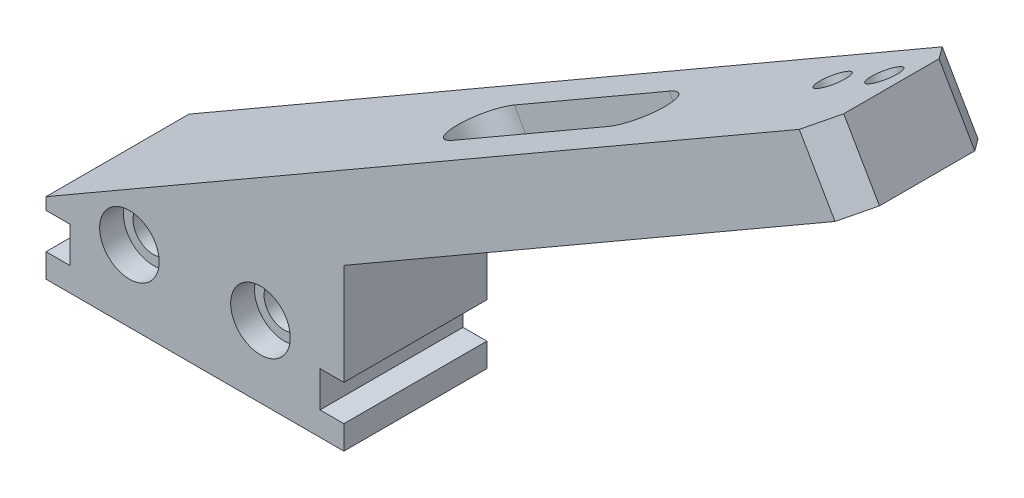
ISO-10303-21;
HEADER;
FILE_DESCRIPTION(('STEP AP214'),'2;1');
FILE_NAME('part.step','',(''),(''),'','','');
FILE_SCHEMA(('AUTOMOTIVE_DESIGN { 1 0 10303 214 1 1 1 1 }'));
ENDSEC;
DATA;
#1=APPLICATION_CONTEXT('core data for automotive mechanical design processes');
#2=APPLICATION_PROTOCOL_DEFINITION('international standard','automotive_design',2000,#1);
#3=PRODUCT_CONTEXT('',#1,'mechanical');
#4=PRODUCT('Part','Part','',(#3));
#5=PRODUCT_RELATED_PRODUCT_CATEGORY('part','',(#4));
#6=PRODUCT_DEFINITION_FORMATION('','',#4);
#7=PRODUCT_DEFINITION_CONTEXT('part definition',#1,'design');
#8=PRODUCT_DEFINITION('design','',#6,#7);
#9=PRODUCT_DEFINITION_SHAPE('','',#8);
#10=(LENGTH_UNIT() NAMED_UNIT(*) SI_UNIT(.MILLI.,.METRE.));
#11=(NAMED_UNIT(*) PLANE_ANGLE_UNIT() SI_UNIT($,.RADIAN.));
#12=(NAMED_UNIT(*) SI_UNIT($,.STERADIAN.) SOLID_ANGLE_UNIT());
#13=UNCERTAINTY_MEASURE_WITH_UNIT(LENGTH_MEASURE(1.E-05),#10,'distance_accuracy_value','');
#14=(GEOMETRIC_REPRESENTATION_CONTEXT(3) GLOBAL_UNCERTAINTY_ASSIGNED_CONTEXT((#13)) GLOBAL_UNIT_ASSIGNED_CONTEXT((#10,
#11,#12)) REPRESENTATION_CONTEXT('',''));
#15=CARTESIAN_POINT('',(0.,0.,0.));
#16=DIRECTION('',(0.,0.,1.));
#17=DIRECTION('',(1.,0.,0.));
#18=AXIS2_PLACEMENT_3D('',#15,#16,#17);
#19=CARTESIAN_POINT('',(29.3301270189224,-84.2630029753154,12.));
#20=DIRECTION('',(-1.,0.,0.));
#21=DIRECTION('',(0.,0.,1.));
#22=AXIS2_PLACEMENT_3D('',#19,#20,#21);
#23=PLANE('',#22);
#24=DIRECTION('',(0.,1.,0.));
#25=VECTOR('',#24,1.);
#26=CARTESIAN_POINT('',(29.3301270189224,-84.2630029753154,0.));
#27=LINE('',#26,#25);
#28=CARTESIAN_POINT('',(29.3301270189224,-84.2630029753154,0.));
#29=VERTEX_POINT('',#28);
#30=CARTESIAN_POINT('',(29.3301270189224,-82.2630029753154,0.));
#31=VERTEX_POINT('',#30);
#32=EDGE_CURVE('E289',#29,#31,#27,.T.);
#33=ORIENTED_EDGE('',*,*,#32,.T.);
#34=DIRECTION('',(0.,0.,1.));
#35=VECTOR('',#34,1.);
#36=CARTESIAN_POINT('',(29.3301270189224,-82.2630029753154,12.));
#37=LINE('',#36,#35);
#38=CARTESIAN_POINT('',(29.3301270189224,-82.2630029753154,12.));
#39=VERTEX_POINT('',#38);
#40=EDGE_CURVE('E167',#31,#39,#37,.T.);
#41=ORIENTED_EDGE('',*,*,#40,.T.);
#42=DIRECTION('',(0.,1.,0.));
#43=VECTOR('',#42,1.);
#44=CARTESIAN_POINT('',(29.3301270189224,-84.2630029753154,12.));
#45=LINE('',#44,#43);
#46=CARTESIAN_POINT('',(29.3301270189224,-84.2630029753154,12.));
#47=VERTEX_POINT('',#46);
#48=EDGE_CURVE('E273',#47,#39,#45,.T.);
#49=ORIENTED_EDGE('',*,*,#48,.F.);
#50=DIRECTION('',(0.,0.,-1.));
#51=VECTOR('',#50,1.);
#52=CARTESIAN_POINT('',(29.3301270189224,-84.2630029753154,12.));
#53=LINE('',#52,#51);
#54=EDGE_CURVE('E313',#47,#29,#53,.T.);
#55=ORIENTED_EDGE('',*,*,#54,.T.);
#56=EDGE_LOOP('',(#33,#41,#49,#55));
#57=FACE_BOUND('',#56,.T.);
#58=ADVANCED_FACE('F16',(#57),#23,.F.);
#59=CARTESIAN_POINT('',(4.33012701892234,-84.2630029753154,12.));
#60=DIRECTION('',(1.,0.,0.));
#61=DIRECTION('',(0.,1.,0.));
#62=AXIS2_PLACEMENT_3D('',#59,#60,#61);
#63=PLANE('',#62);
#64=DIRECTION('',(0.,-1.,0.));
#65=VECTOR('',#64,1.);
#66=CARTESIAN_POINT('',(4.33012701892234,-84.2630029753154,12.));
#67=LINE('',#66,#65);
#68=CARTESIAN_POINT('',(4.3301270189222,-82.2630029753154,12.));
#69=VERTEX_POINT('',#68);
#70=CARTESIAN_POINT('',(4.33012701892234,-84.2630029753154,12.));
#71=VERTEX_POINT('',#70);
#72=EDGE_CURVE('E281',#69,#71,#67,.T.);
#73=ORIENTED_EDGE('',*,*,#72,.F.);
#74=DIRECTION('',(0.,0.,-1.));
#75=VECTOR('',#74,1.);
#76=CARTESIAN_POINT('',(4.3301270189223,-82.2630029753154,12.));
#77=LINE('',#76,#75);
#78=CARTESIAN_POINT('',(4.3301270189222,-82.2630029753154,0.));
#79=VERTEX_POINT('',#78);
#80=EDGE_CURVE('E202',#69,#79,#77,.T.);
#81=ORIENTED_EDGE('',*,*,#80,.T.);
#82=DIRECTION('',(0.,-1.,0.));
#83=VECTOR('',#82,1.);
#84=CARTESIAN_POINT('',(4.33012701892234,-84.2630029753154,0.));
#85=LINE('',#84,#83);
#86=CARTESIAN_POINT('',(4.33012701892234,-84.2630029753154,0.));
#87=VERTEX_POINT('',#86);
#88=EDGE_CURVE('E296',#79,#87,#85,.T.);
#89=ORIENTED_EDGE('',*,*,#88,.T.);
#90=DIRECTION('',(0.,0.,-1.));
#91=VECTOR('',#90,1.);
#92=CARTESIAN_POINT('',(4.33012701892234,-84.2630029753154,12.));
#93=LINE('',#92,#91);
#94=EDGE_CURVE('E285',#71,#87,#93,.T.);
#95=ORIENTED_EDGE('',*,*,#94,.F.);
#96=EDGE_LOOP('',(#73,#81,#89,#95));
#97=FACE_BOUND('',#96,.T.);
#98=ADVANCED_FACE('F360',(#97),#63,.F.);
#99=CARTESIAN_POINT('',(4.33012701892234,-84.2630029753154,12.));
#100=DIRECTION('',(0.,1.,0.));
#101=DIRECTION('',(0.,0.,1.));
#102=AXIS2_PLACEMENT_3D('',#99,#100,#101);
#103=PLANE('',#102);
#104=DIRECTION('',(1.,0.,0.));
#105=VECTOR('',#104,1.);
#106=CARTESIAN_POINT('',(4.33012701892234,-84.2630029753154,0.));
#107=LINE('',#106,#105);
#108=EDGE_CURVE('E265',#87,#29,#107,.T.);
#109=ORIENTED_EDGE('',*,*,#108,.T.);
#110=ORIENTED_EDGE('',*,*,#54,.F.);
#111=DIRECTION('',(1.,0.,0.));
#112=VECTOR('',#111,1.);
#113=CARTESIAN_POINT('',(4.33012701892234,-84.2630029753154,12.));
#114=LINE('',#113,#112);
#115=EDGE_CURVE('E268',#71,#47,#114,.T.);
#116=ORIENTED_EDGE('',*,*,#115,.F.);
#117=ORIENTED_EDGE('',*,*,#94,.T.);
#118=EDGE_LOOP('',(#109,#110,#116,#117));
#119=FACE_BOUND('',#118,.T.);
#120=ADVANCED_FACE('F407',(#119),#103,.F.);
#121=CARTESIAN_POINT('',(29.3301270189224,-79.2630029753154,12.));
#122=VERTEX_POINT('',#121);
#123=CARTESIAN_POINT('',(29.3301270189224,-70.7574494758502,12.));
#124=VERTEX_POINT('',#123);
#125=EDGE_CURVE('E271',#122,#124,#45,.T.);
#126=ORIENTED_EDGE('',*,*,#125,.F.);
#127=DIRECTION('',(0.,0.,-1.));
#128=VECTOR('',#127,1.);
#129=CARTESIAN_POINT('',(29.3301270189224,-79.2630029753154,12.));
#130=LINE('',#129,#128);
#131=CARTESIAN_POINT('',(29.3301270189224,-79.2630029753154,0.));
#132=VERTEX_POINT('',#131);
#133=EDGE_CURVE('E160',#122,#132,#130,.T.);
#134=ORIENTED_EDGE('',*,*,#133,.T.);
#135=CARTESIAN_POINT('',(29.3301270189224,-70.7574494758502,0.));
#136=VERTEX_POINT('',#135);
#137=EDGE_CURVE('E288',#132,#136,#27,.T.);
#138=ORIENTED_EDGE('',*,*,#137,.T.);
#139=DIRECTION('',(0.,0.,-1.));
#140=VECTOR('',#139,1.);
#141=CARTESIAN_POINT('',(29.3301270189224,-70.7574494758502,12.));
#142=LINE('',#141,#140);
#143=EDGE_CURVE('E310',#124,#136,#142,.T.);
#144=ORIENTED_EDGE('',*,*,#143,.F.);
#145=EDGE_LOOP('',(#126,#134,#138,#144));
#146=FACE_BOUND('',#145,.T.);
#147=ADVANCED_FACE('F402',(#146),#23,.F.);
#148=CARTESIAN_POINT('',(72.2820323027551,-45.9591553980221,12.));
#149=DIRECTION('',(-0.5,0.866025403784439,0.));
#150=DIRECTION('',(-0.866025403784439,-0.5,0.));
#151=AXIS2_PLACEMENT_3D('',#148,#149,#150);
#152=PLANE('',#151);
#153=DIRECTION('',(0.866025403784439,0.5,0.));
#154=VECTOR('',#153,1.);
#155=CARTESIAN_POINT('',(38.0740288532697,-65.7091553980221,3.43164048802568));
#156=LINE('',#155,#154);
#157=CARTESIAN_POINT('',(38.0740288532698,-65.7091553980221,3.43164048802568));
#158=VERTEX_POINT('',#157);
#159=CARTESIAN_POINT('',(51.0644099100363,-58.2091553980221,3.43164048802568));
#160=VERTEX_POINT('',#159);
#161=EDGE_CURVE('E207',#158,#160,#156,.T.);
#162=ORIENTED_EDGE('',*,*,#161,.F.);
#163=CARTESIAN_POINT('',(38.0740288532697,-65.7091553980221,6.));
#164=DIRECTION('',(0.5,-0.866025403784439,0.));
#165=DIRECTION('',(0.866025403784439,0.5,0.));
#166=AXIS2_PLACEMENT_3D('',#163,#164,#165);
#167=CIRCLE('',#166,2.56835951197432);
#168=CARTESIAN_POINT('',(38.0740288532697,-65.7091553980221,8.56835951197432));
#169=VERTEX_POINT('',#168);
#170=EDGE_CURVE('E205',#169,#158,#167,.T.);
#171=ORIENTED_EDGE('',*,*,#170,.F.);
#172=DIRECTION('',(-0.866025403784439,-0.5,0.));
#173=VECTOR('',#172,1.);
#174=CARTESIAN_POINT('',(38.0740288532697,-65.7091553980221,8.56835951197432));
#175=LINE('',#174,#173);
#176=CARTESIAN_POINT('',(51.0644099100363,-58.2091553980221,8.56835951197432));
#177=VERTEX_POINT('',#176);
#178=EDGE_CURVE('E213',#177,#169,#175,.T.);
#179=ORIENTED_EDGE('',*,*,#178,.F.);
#180=CARTESIAN_POINT('',(51.0644099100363,-58.2091553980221,6.));
#181=DIRECTION('',(0.5,-0.866025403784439,0.));
#182=DIRECTION('',(0.866025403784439,0.5,0.));
#183=AXIS2_PLACEMENT_3D('',#180,#181,#182);
#184=CIRCLE('',#183,2.56835951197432);
#185=EDGE_CURVE('E210',#160,#177,#184,.T.);
#186=ORIENTED_EDGE('',*,*,#185,.F.);
#187=EDGE_LOOP('',(#162,#171,#179,#186));
#188=FACE_BOUND('',#187,.T.);
#189=CARTESIAN_POINT('',(69.683956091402,-47.4591553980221,4.));
#190=DIRECTION('',(0.5,-0.86602540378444,0.));
#191=DIRECTION('',(0.86602540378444,0.5,0.));
#192=AXIS2_PLACEMENT_3D('',#189,#190,#191);
#193=CIRCLE('',#192,1.24999999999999);
#194=CARTESIAN_POINT('',(70.7664878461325,-46.8341553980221,4.));
#195=VERTEX_POINT('',#194);
#196=EDGE_CURVE('E219',#195,#195,#193,.T.);
#197=ORIENTED_EDGE('',*,*,#196,.F.);
#198=EDGE_LOOP('',(#197));
#199=FACE_BOUND('',#198,.T.);
#200=CARTESIAN_POINT('',(65.3538290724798,-49.959155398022,4.));
#201=DIRECTION('',(0.5,-0.86602540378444,0.));
#202=DIRECTION('',(0.86602540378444,0.5,0.));
#203=AXIS2_PLACEMENT_3D('',#200,#201,#202);
#204=CIRCLE('',#203,1.24999999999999);
#205=CARTESIAN_POINT('',(66.4363608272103,-49.334155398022,4.));
#206=VERTEX_POINT('',#205);
#207=EDGE_CURVE('E229',#206,#206,#204,.T.);
#208=ORIENTED_EDGE('',*,*,#207,.F.);
#209=EDGE_LOOP('',(#208));
#210=FACE_BOUND('',#209,.T.);
#211=DIRECTION('',(0.866025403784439,0.5,0.));
#212=VECTOR('',#211,1.);
#213=CARTESIAN_POINT('',(72.2820323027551,-45.9591553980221,0.));
#214=LINE('',#213,#212);
#215=CARTESIAN_POINT('',(70.5499814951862,-46.9591553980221,0.));
#216=VERTEX_POINT('',#215);
#217=EDGE_CURVE('E291',#136,#216,#214,.T.);
#218=ORIENTED_EDGE('',*,*,#217,.T.);
#219=DIRECTION('',(-0.612372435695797,-0.353553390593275,-0.707106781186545));
#220=VECTOR('',#219,1.);
#221=CARTESIAN_POINT('',(72.2820323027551,-45.9591553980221,2.));
#222=LINE('',#221,#220);
#223=CARTESIAN_POINT('',(72.2820323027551,-45.9591553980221,2.));
#224=VERTEX_POINT('',#223);
#225=EDGE_CURVE('E335',#216,#224,#222,.F.);
#226=ORIENTED_EDGE('',*,*,#225,.T.);
#227=DIRECTION('',(0.,0.,-1.));
#228=VECTOR('',#227,1.);
#229=CARTESIAN_POINT('',(72.2820323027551,-45.9591553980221,12.));
#230=LINE('',#229,#228);
#231=CARTESIAN_POINT('',(72.2820323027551,-45.9591553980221,10.));
#232=VERTEX_POINT('',#231);
#233=EDGE_CURVE('E307',#232,#224,#230,.T.);
#234=ORIENTED_EDGE('',*,*,#233,.F.);
#235=DIRECTION('',(-0.612372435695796,-0.353553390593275,0.707106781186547));
#236=VECTOR('',#235,1.);
#237=CARTESIAN_POINT('',(70.5499814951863,-46.959155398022,11.9999999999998));
#238=LINE('',#237,#236);
#239=CARTESIAN_POINT('',(70.5499814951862,-46.9591553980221,12.));
#240=VERTEX_POINT('',#239);
#241=EDGE_CURVE('E333',#232,#240,#238,.T.);
#242=ORIENTED_EDGE('',*,*,#241,.T.);
#243=DIRECTION('',(0.866025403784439,0.5,0.));
#244=VECTOR('',#243,1.);
#245=CARTESIAN_POINT('',(72.2820323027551,-45.9591553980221,12.));
#246=LINE('',#245,#244);
#247=EDGE_CURVE('E276',#124,#240,#246,.T.);
#248=ORIENTED_EDGE('',*,*,#247,.F.);
#249=ORIENTED_EDGE('',*,*,#143,.T.);
#250=EDGE_LOOP('',(#218,#226,#234,#242,#248,#249));
#251=FACE_BOUND('',#250,.T.);
#252=ADVANCED_FACE('F389',(#188,#199,#210,#251),#152,.F.);
#253=CARTESIAN_POINT('',(69.2820323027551,-40.7630029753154,12.));
#254=DIRECTION('',(-0.866025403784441,-0.5,0.));
#255=DIRECTION('',(0.5,-0.866025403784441,0.));
#256=AXIS2_PLACEMENT_3D('',#253,#254,#255);
#257=PLANE('',#256);
#258=ORIENTED_EDGE('',*,*,#233,.T.);
#259=DIRECTION('',(-0.5,0.866025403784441,0.));
#260=VECTOR('',#259,1.);
#261=CARTESIAN_POINT('',(69.2820323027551,-40.7630029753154,2.));
#262=LINE('',#261,#260);
#263=CARTESIAN_POINT('',(69.2820323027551,-40.7630029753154,2.));
#264=VERTEX_POINT('',#263);
#265=EDGE_CURVE('E324',#224,#264,#262,.T.);
#266=ORIENTED_EDGE('',*,*,#265,.T.);
#267=DIRECTION('',(0.,0.,-1.));
#268=VECTOR('',#267,1.);
#269=CARTESIAN_POINT('',(69.2820323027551,-40.7630029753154,12.));
#270=LINE('',#269,#268);
#271=CARTESIAN_POINT('',(69.2820323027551,-40.7630029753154,10.));
#272=VERTEX_POINT('',#271);
#273=EDGE_CURVE('E304',#272,#264,#270,.T.);
#274=ORIENTED_EDGE('',*,*,#273,.F.);
#275=DIRECTION('',(0.5,-0.866025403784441,0.));
#276=VECTOR('',#275,1.);
#277=CARTESIAN_POINT('',(72.2820323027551,-45.9591553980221,10.));
#278=LINE('',#277,#276);
#279=EDGE_CURVE('E316',#272,#232,#278,.T.);
#280=ORIENTED_EDGE('',*,*,#279,.T.);
#281=EDGE_LOOP('',(#258,#266,#274,#280));
#282=FACE_BOUND('',#281,.T.);
#283=ADVANCED_FACE('F392',(#282),#257,.F.);
#284=CARTESIAN_POINT('',(69.2820323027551,-40.7630029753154,12.));
#285=DIRECTION('',(0.5,-0.866025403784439,0.));
#286=DIRECTION('',(0.866025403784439,0.5,0.));
#287=AXIS2_PLACEMENT_3D('',#284,#285,#286);
#288=PLANE('',#287);
#289=DIRECTION('',(-0.866025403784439,-0.5,0.));
#290=VECTOR('',#289,1.);
#291=CARTESIAN_POINT('',(69.2820323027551,-40.7630029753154,8.56835951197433));
#292=LINE('',#291,#290);
#293=CARTESIAN_POINT('',(48.0644099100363,-53.0130029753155,8.56835951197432));
#294=VERTEX_POINT('',#293);
#295=CARTESIAN_POINT('',(35.0740288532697,-60.5130029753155,8.56835951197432));
#296=VERTEX_POINT('',#295);
#297=EDGE_CURVE('E346',#294,#296,#292,.T.);
#298=ORIENTED_EDGE('',*,*,#297,.T.);
#299=CARTESIAN_POINT('',(35.0740288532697,-60.5130029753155,6.));
#300=DIRECTION('',(0.5,-0.866025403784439,0.));
#301=DIRECTION('',(0.866025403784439,0.5,0.));
#302=AXIS2_PLACEMENT_3D('',#299,#300,#301);
#303=CIRCLE('',#302,2.56835951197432);
#304=CARTESIAN_POINT('',(35.0740288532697,-60.5130029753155,3.43164048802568));
#305=VERTEX_POINT('',#304);
#306=EDGE_CURVE('E349',#296,#305,#303,.T.);
#307=ORIENTED_EDGE('',*,*,#306,.T.);
#308=DIRECTION('',(0.866025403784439,0.5,0.));
#309=VECTOR('',#308,1.);
#310=CARTESIAN_POINT('',(69.2820323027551,-40.7630029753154,3.43164048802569));
#311=LINE('',#310,#309);
#312=CARTESIAN_POINT('',(48.0644099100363,-53.0130029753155,3.43164048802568));
#313=VERTEX_POINT('',#312);
#314=EDGE_CURVE('E340',#305,#313,#311,.T.);
#315=ORIENTED_EDGE('',*,*,#314,.T.);
#316=CARTESIAN_POINT('',(48.0644099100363,-53.0130029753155,6.));
#317=DIRECTION('',(0.5,-0.866025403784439,0.));
#318=DIRECTION('',(0.866025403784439,0.5,0.));
#319=AXIS2_PLACEMENT_3D('',#316,#317,#318);
#320=CIRCLE('',#319,2.56835951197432);
#321=EDGE_CURVE('E343',#313,#294,#320,.T.);
#322=ORIENTED_EDGE('',*,*,#321,.T.);
#323=EDGE_LOOP('',(#298,#307,#315,#322));
#324=FACE_BOUND('',#323,.T.);
#325=CARTESIAN_POINT('',(66.6839560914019,-42.2630029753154,4.));
#326=DIRECTION('',(0.5,-0.866025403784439,0.));
#327=DIRECTION('',(0.866025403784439,0.5,0.));
#328=AXIS2_PLACEMENT_3D('',#325,#326,#327);
#329=CIRCLE('',#328,1.25);
#330=CARTESIAN_POINT('',(67.7664878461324,-41.6380029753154,4.));
#331=VERTEX_POINT('',#330);
#332=EDGE_CURVE('E228',#331,#331,#329,.T.);
#333=ORIENTED_EDGE('',*,*,#332,.T.);
#334=EDGE_LOOP('',(#333));
#335=FACE_BOUND('',#334,.T.);
#336=CARTESIAN_POINT('',(62.3538290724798,-44.7630029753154,4.));
#337=DIRECTION('',(0.5,-0.866025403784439,0.));
#338=DIRECTION('',(0.866025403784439,0.5,0.));
#339=AXIS2_PLACEMENT_3D('',#336,#337,#338);
#340=CIRCLE('',#339,1.25);
#341=CARTESIAN_POINT('',(63.4363608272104,-44.1380029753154,4.));
#342=VERTEX_POINT('',#341);
#343=EDGE_CURVE('E232',#342,#342,#340,.T.);
#344=ORIENTED_EDGE('',*,*,#343,.T.);
#345=EDGE_LOOP('',(#344));
#346=FACE_BOUND('',#345,.T.);
#347=ORIENTED_EDGE('',*,*,#273,.T.);
#348=DIRECTION('',(0.612372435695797,0.353553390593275,0.707106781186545));
#349=VECTOR('',#348,1.);
#350=CARTESIAN_POINT('',(69.2820323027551,-40.7630029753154,2.));
#351=LINE('',#350,#349);
#352=CARTESIAN_POINT('',(67.5499814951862,-41.7630029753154,0.));
#353=VERTEX_POINT('',#352);
#354=EDGE_CURVE('E329',#264,#353,#351,.F.);
#355=ORIENTED_EDGE('',*,*,#354,.T.);
#356=DIRECTION('',(-0.866025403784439,-0.5,0.));
#357=VECTOR('',#356,1.);
#358=CARTESIAN_POINT('',(69.2820323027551,-40.7630029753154,0.));
#359=LINE('',#358,#357);
#360=CARTESIAN_POINT('',(4.3301270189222,-78.2630029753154,0.));
#361=VERTEX_POINT('',#360);
#362=EDGE_CURVE('E294',#353,#361,#359,.T.);
#363=ORIENTED_EDGE('',*,*,#362,.T.);
#364=DIRECTION('',(0.,0.,-1.));
#365=VECTOR('',#364,1.);
#366=CARTESIAN_POINT('',(4.3301270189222,-78.2630029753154,12.));
#367=LINE('',#366,#365);
#368=CARTESIAN_POINT('',(4.3301270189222,-78.2630029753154,12.));
#369=VERTEX_POINT('',#368);
#370=EDGE_CURVE('E301',#369,#361,#367,.T.);
#371=ORIENTED_EDGE('',*,*,#370,.F.);
#372=DIRECTION('',(-0.866025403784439,-0.5,0.));
#373=VECTOR('',#372,1.);
#374=CARTESIAN_POINT('',(69.2820323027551,-40.7630029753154,12.));
#375=LINE('',#374,#373);
#376=CARTESIAN_POINT('',(67.5499814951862,-41.7630029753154,12.));
#377=VERTEX_POINT('',#376);
#378=EDGE_CURVE('E279',#377,#369,#375,.T.);
#379=ORIENTED_EDGE('',*,*,#378,.F.);
#380=DIRECTION('',(0.612372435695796,0.353553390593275,-0.707106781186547));
#381=VECTOR('',#380,1.);
#382=CARTESIAN_POINT('',(67.5499814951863,-41.7630029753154,11.9999999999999));
#383=LINE('',#382,#381);
#384=EDGE_CURVE('E327',#377,#272,#383,.T.);
#385=ORIENTED_EDGE('',*,*,#384,.T.);
#386=EDGE_LOOP('',(#347,#355,#363,#371,#379,#385));
#387=FACE_BOUND('',#386,.T.);
#388=ADVANCED_FACE('F380',(#324,#335,#346,#387),#288,.F.);
#389=CARTESIAN_POINT('',(4.33012701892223,-79.2630029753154,0.));
#390=VERTEX_POINT('',#389);
#391=EDGE_CURVE('E272',#361,#390,#85,.T.);
#392=ORIENTED_EDGE('',*,*,#391,.T.);
#393=DIRECTION('',(0.,0.,1.));
#394=VECTOR('',#393,1.);
#395=CARTESIAN_POINT('',(4.33012701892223,-79.2630029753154,12.));
#396=LINE('',#395,#394);
#397=CARTESIAN_POINT('',(4.3301270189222,-79.2630029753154,12.));
#398=VERTEX_POINT('',#397);
#399=EDGE_CURVE('E39',#390,#398,#396,.T.);
#400=ORIENTED_EDGE('',*,*,#399,.T.);
#401=EDGE_CURVE('E282',#369,#398,#67,.T.);
#402=ORIENTED_EDGE('',*,*,#401,.F.);
#403=ORIENTED_EDGE('',*,*,#370,.T.);
#404=EDGE_LOOP('',(#392,#400,#402,#403));
#405=FACE_BOUND('',#404,.T.);
#406=ADVANCED_FACE('F375',(#405),#63,.F.);
#407=CARTESIAN_POINT('',(0.,0.,12.));
#408=DIRECTION('',(0.,0.,1.));
#409=DIRECTION('',(1.,0.,0.));
#410=AXIS2_PLACEMENT_3D('',#407,#408,#409);
#411=PLANE('',#410);
#412=DIRECTION('',(1.,0.,0.));
#413=VECTOR('',#412,1.);
#414=CARTESIAN_POINT('',(31.3301270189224,-82.2630029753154,12.));
#415=LINE('',#414,#413);
#416=CARTESIAN_POINT('',(27.3301270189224,-82.2630029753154,12.));
#417=VERTEX_POINT('',#416);
#418=EDGE_CURVE('E173',#417,#39,#415,.T.);
#419=ORIENTED_EDGE('',*,*,#418,.F.);
#420=DIRECTION('',(0.,-1.,0.));
#421=VECTOR('',#420,1.);
#422=CARTESIAN_POINT('',(27.3301270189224,-79.2630029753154,12.));
#423=LINE('',#422,#421);
#424=CARTESIAN_POINT('',(27.3301270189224,-79.2630029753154,12.));
#425=VERTEX_POINT('',#424);
#426=EDGE_CURVE('E157',#425,#417,#423,.T.);
#427=ORIENTED_EDGE('',*,*,#426,.F.);
#428=DIRECTION('',(-1.,0.,0.));
#429=VECTOR('',#428,1.);
#430=CARTESIAN_POINT('',(31.3301270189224,-79.2630029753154,12.));
#431=LINE('',#430,#429);
#432=EDGE_CURVE('E177',#122,#425,#431,.T.);
#433=ORIENTED_EDGE('',*,*,#432,.F.);
#434=ORIENTED_EDGE('',*,*,#125,.T.);
#435=ORIENTED_EDGE('',*,*,#247,.T.);
#436=DIRECTION('',(-0.5,0.866025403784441,0.));
#437=VECTOR('',#436,1.);
#438=CARTESIAN_POINT('',(67.5499814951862,-41.7630029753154,12.));
#439=LINE('',#438,#437);
#440=EDGE_CURVE('E337',#240,#377,#439,.T.);
#441=ORIENTED_EDGE('',*,*,#440,.T.);
#442=ORIENTED_EDGE('',*,*,#378,.T.);
#443=ORIENTED_EDGE('',*,*,#401,.T.);
#444=DIRECTION('',(-1.,0.,0.));
#445=VECTOR('',#444,1.);
#446=CARTESIAN_POINT('',(2.33012701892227,-79.2630029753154,12.));
#447=LINE('',#446,#445);
#448=CARTESIAN_POINT('',(6.33012701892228,-79.2630029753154,12.));
#449=VERTEX_POINT('',#448);
#450=EDGE_CURVE('E194',#449,#398,#447,.T.);
#451=ORIENTED_EDGE('',*,*,#450,.F.);
#452=DIRECTION('',(0.,1.,0.));
#453=VECTOR('',#452,1.);
#454=CARTESIAN_POINT('',(6.33012701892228,-79.2630029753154,12.));
#455=LINE('',#454,#453);
#456=CARTESIAN_POINT('',(6.33012701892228,-82.2630029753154,12.));
#457=VERTEX_POINT('',#456);
#458=EDGE_CURVE('E184',#457,#449,#455,.T.);
#459=ORIENTED_EDGE('',*,*,#458,.F.);
#460=DIRECTION('',(1.,0.,0.));
#461=VECTOR('',#460,1.);
#462=CARTESIAN_POINT('',(2.33012701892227,-82.2630029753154,12.));
#463=LINE('',#462,#461);
#464=EDGE_CURVE('E189',#69,#457,#463,.T.);
#465=ORIENTED_EDGE('',*,*,#464,.F.);
#466=ORIENTED_EDGE('',*,*,#72,.T.);
#467=ORIENTED_EDGE('',*,*,#115,.T.);
#468=ORIENTED_EDGE('',*,*,#48,.T.);
#469=EDGE_LOOP('',(#419,#427,#433,#434,#435,#441,#442,#443,#451,#459,#465,#466,#467,#468));
#470=FACE_BOUND('',#469,.T.);
#471=CARTESIAN_POINT('',(11.3301270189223,-78.2630029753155,12.));
#472=DIRECTION('',(0.,0.,1.));
#473=DIRECTION('',(1.,0.,0.));
#474=AXIS2_PLACEMENT_3D('',#471,#472,#473);
#475=CIRCLE('',#474,2.5);
#476=CARTESIAN_POINT('',(13.8301270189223,-78.2630029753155,12.));
#477=VERTEX_POINT('',#476);
#478=EDGE_CURVE('E259',#477,#477,#475,.T.);
#479=ORIENTED_EDGE('',*,*,#478,.F.);
#480=EDGE_LOOP('',(#479));
#481=FACE_BOUND('',#480,.T.);
#482=CARTESIAN_POINT('',(22.3301270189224,-78.2630029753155,12.));
#483=DIRECTION('',(0.,0.,1.));
#484=DIRECTION('',(1.,0.,0.));
#485=AXIS2_PLACEMENT_3D('',#482,#483,#484);
#486=CIRCLE('',#485,2.5);
#487=CARTESIAN_POINT('',(24.8301270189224,-78.2630029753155,12.));
#488=VERTEX_POINT('',#487);
#489=EDGE_CURVE('E258',#488,#488,#486,.T.);
#490=ORIENTED_EDGE('',*,*,#489,.F.);
#491=EDGE_LOOP('',(#490));
#492=FACE_BOUND('',#491,.T.);
#493=ADVANCED_FACE('F364',(#470,#481,#492),#411,.T.);
#494=CARTESIAN_POINT('',(0.,0.,0.));
#495=DIRECTION('',(0.,0.,1.));
#496=DIRECTION('',(1.,0.,0.));
#497=AXIS2_PLACEMENT_3D('',#494,#495,#496);
#498=PLANE('',#497);
#499=CARTESIAN_POINT('',(11.3301270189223,-78.2630029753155,0.));
#500=DIRECTION('',(0.,0.,-1.));
#501=DIRECTION('',(-1.,0.,0.));
#502=AXIS2_PLACEMENT_3D('',#499,#500,#501);
#503=CIRCLE('',#502,3.);
#504=CARTESIAN_POINT('',(8.33012701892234,-78.2630029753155,0.));
#505=VERTEX_POINT('',#504);
#506=EDGE_CURVE('E235',#505,#505,#503,.T.);
#507=ORIENTED_EDGE('',*,*,#506,.F.);
#508=EDGE_LOOP('',(#507));
#509=FACE_BOUND('',#508,.T.);
#510=CARTESIAN_POINT('',(22.3301270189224,-78.2630029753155,0.));
#511=DIRECTION('',(0.,0.,-1.));
#512=DIRECTION('',(-1.,0.,0.));
#513=AXIS2_PLACEMENT_3D('',#510,#511,#512);
#514=CIRCLE('',#513,3.);
#515=CARTESIAN_POINT('',(19.3301270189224,-78.2630029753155,0.));
#516=VERTEX_POINT('',#515);
#517=EDGE_CURVE('E245',#516,#516,#514,.T.);
#518=ORIENTED_EDGE('',*,*,#517,.F.);
#519=EDGE_LOOP('',(#518));
#520=FACE_BOUND('',#519,.T.);
#521=DIRECTION('',(0.,-1.,0.));
#522=VECTOR('',#521,1.);
#523=CARTESIAN_POINT('',(27.3301270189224,-79.2630029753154,0.));
#524=LINE('',#523,#522);
#525=CARTESIAN_POINT('',(27.3301270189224,-79.2630029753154,0.));
#526=VERTEX_POINT('',#525);
#527=CARTESIAN_POINT('',(27.3301270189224,-82.2630029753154,0.));
#528=VERTEX_POINT('',#527);
#529=EDGE_CURVE('E31',#526,#528,#524,.T.);
#530=ORIENTED_EDGE('',*,*,#529,.T.);
#531=DIRECTION('',(1.,0.,0.));
#532=VECTOR('',#531,1.);
#533=CARTESIAN_POINT('',(31.3301270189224,-82.2630029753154,0.));
#534=LINE('',#533,#532);
#535=EDGE_CURVE('E164',#528,#31,#534,.T.);
#536=ORIENTED_EDGE('',*,*,#535,.T.);
#537=ORIENTED_EDGE('',*,*,#32,.F.);
#538=ORIENTED_EDGE('',*,*,#108,.F.);
#539=ORIENTED_EDGE('',*,*,#88,.F.);
#540=DIRECTION('',(1.,0.,0.));
#541=VECTOR('',#540,1.);
#542=CARTESIAN_POINT('',(0.,-82.2630029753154,0.));
#543=LINE('',#542,#541);
#544=CARTESIAN_POINT('',(6.33012701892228,-82.2630029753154,0.));
#545=VERTEX_POINT('',#544);
#546=EDGE_CURVE('E24',#79,#545,#543,.T.);
#547=ORIENTED_EDGE('',*,*,#546,.T.);
#548=DIRECTION('',(0.,1.,0.));
#549=VECTOR('',#548,1.);
#550=CARTESIAN_POINT('',(6.33012701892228,-79.2630029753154,0.));
#551=LINE('',#550,#549);
#552=CARTESIAN_POINT('',(6.33012701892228,-79.2630029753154,0.));
#553=VERTEX_POINT('',#552);
#554=EDGE_CURVE('E185',#545,#553,#551,.T.);
#555=ORIENTED_EDGE('',*,*,#554,.T.);
#556=DIRECTION('',(-1.,0.,0.));
#557=VECTOR('',#556,1.);
#558=CARTESIAN_POINT('',(2.33012701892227,-79.2630029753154,0.));
#559=LINE('',#558,#557);
#560=EDGE_CURVE('E188',#553,#390,#559,.T.);
#561=ORIENTED_EDGE('',*,*,#560,.T.);
#562=ORIENTED_EDGE('',*,*,#391,.F.);
#563=ORIENTED_EDGE('',*,*,#362,.F.);
#564=DIRECTION('',(0.5,-0.866025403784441,0.));
#565=VECTOR('',#564,1.);
#566=CARTESIAN_POINT('',(32.5785753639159,18.8092492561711,0.));
#567=LINE('',#566,#565);
#568=EDGE_CURVE('E331',#353,#216,#567,.T.);
#569=ORIENTED_EDGE('',*,*,#568,.T.);
#570=ORIENTED_EDGE('',*,*,#217,.F.);
#571=ORIENTED_EDGE('',*,*,#137,.F.);
#572=DIRECTION('',(-1.,0.,0.));
#573=VECTOR('',#572,1.);
#574=CARTESIAN_POINT('',(0.,-79.2630029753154,0.));
#575=LINE('',#574,#573);
#576=EDGE_CURVE('E11',#132,#526,#575,.T.);
#577=ORIENTED_EDGE('',*,*,#576,.T.);
#578=EDGE_LOOP('',(#530,#536,#537,#538,#539,#547,#555,#561,#562,#563,#569,#570,#571,#577));
#579=FACE_BOUND('',#578,.T.);
#580=ADVANCED_FACE('F171',(#509,#520,#579),#498,.F.);
#581=CARTESIAN_POINT('',(22.3301270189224,-78.2630029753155,10.));
#582=DIRECTION('',(0.,0.,1.));
#583=DIRECTION('',(1.,0.,0.));
#584=AXIS2_PLACEMENT_3D('',#581,#582,#583);
#585=CYLINDRICAL_SURFACE('',#584,2.5);
#586=CARTESIAN_POINT('',(22.3301270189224,-78.2630029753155,10.));
#587=DIRECTION('',(0.,0.,1.));
#588=DIRECTION('',(1.,0.,0.));
#589=AXIS2_PLACEMENT_3D('',#586,#587,#588);
#590=CIRCLE('',#589,2.5);
#591=CARTESIAN_POINT('',(24.8301270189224,-78.2630029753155,10.));
#592=VERTEX_POINT('',#591);
#593=EDGE_CURVE('E262',#592,#592,#590,.T.);
#594=ORIENTED_EDGE('',*,*,#593,.F.);
#595=EDGE_LOOP('',(#594));
#596=FACE_BOUND('',#595,.T.);
#597=ORIENTED_EDGE('',*,*,#489,.T.);
#598=EDGE_LOOP('',(#597));
#599=FACE_BOUND('',#598,.T.);
#600=ADVANCED_FACE('F434',(#596,#599),#585,.F.);
#601=CARTESIAN_POINT('',(22.3301270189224,-78.2630029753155,10.));
#602=DIRECTION('',(0.,0.,1.));
#603=DIRECTION('',(1.,0.,0.));
#604=AXIS2_PLACEMENT_3D('',#601,#602,#603);
#605=PLANE('',#604);
#606=CARTESIAN_POINT('',(22.3301270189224,-78.2630029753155,10.));
#607=DIRECTION('',(0.,0.,1.));
#608=DIRECTION('',(1.,0.,0.));
#609=AXIS2_PLACEMENT_3D('',#606,#607,#608);
#610=CIRCLE('',#609,1.7);
#611=CARTESIAN_POINT('',(24.0301270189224,-78.2630029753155,10.));
#612=VERTEX_POINT('',#611);
#613=EDGE_CURVE('E254',#612,#612,#610,.T.);
#614=ORIENTED_EDGE('',*,*,#613,.F.);
#615=EDGE_LOOP('',(#614));
#616=FACE_BOUND('',#615,.T.);
#617=ORIENTED_EDGE('',*,*,#593,.T.);
#618=EDGE_LOOP('',(#617));
#619=FACE_BOUND('',#618,.T.);
#620=ADVANCED_FACE('F440',(#616,#619),#605,.T.);
#621=CARTESIAN_POINT('',(11.3301270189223,-78.2630029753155,10.));
#622=DIRECTION('',(0.,0.,1.));
#623=DIRECTION('',(1.,0.,0.));
#624=AXIS2_PLACEMENT_3D('',#621,#622,#623);
#625=CYLINDRICAL_SURFACE('',#624,2.5);
#626=CARTESIAN_POINT('',(11.3301270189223,-78.2630029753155,10.));
#627=DIRECTION('',(0.,0.,1.));
#628=DIRECTION('',(1.,0.,0.));
#629=AXIS2_PLACEMENT_3D('',#626,#627,#628);
#630=CIRCLE('',#629,2.5);
#631=CARTESIAN_POINT('',(13.8301270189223,-78.2630029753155,10.));
#632=VERTEX_POINT('',#631);
#633=EDGE_CURVE('E255',#632,#632,#630,.T.);
#634=ORIENTED_EDGE('',*,*,#633,.F.);
#635=EDGE_LOOP('',(#634));
#636=FACE_BOUND('',#635,.T.);
#637=ORIENTED_EDGE('',*,*,#478,.T.);
#638=EDGE_LOOP('',(#637));
#639=FACE_BOUND('',#638,.T.);
#640=ADVANCED_FACE('F444',(#636,#639),#625,.F.);
#641=CARTESIAN_POINT('',(11.3301270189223,-78.2630029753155,10.));
#642=DIRECTION('',(0.,0.,1.));
#643=DIRECTION('',(1.,0.,0.));
#644=AXIS2_PLACEMENT_3D('',#641,#642,#643);
#645=PLANE('',#644);
#646=CARTESIAN_POINT('',(11.3301270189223,-78.2630029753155,10.));
#647=DIRECTION('',(0.,0.,1.));
#648=DIRECTION('',(1.,0.,0.));
#649=AXIS2_PLACEMENT_3D('',#646,#647,#648);
#650=CIRCLE('',#649,1.7);
#651=CARTESIAN_POINT('',(13.0301270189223,-78.2630029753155,10.));
#652=VERTEX_POINT('',#651);
#653=EDGE_CURVE('E244',#652,#652,#650,.T.);
#654=ORIENTED_EDGE('',*,*,#653,.F.);
#655=EDGE_LOOP('',(#654));
#656=FACE_BOUND('',#655,.T.);
#657=ORIENTED_EDGE('',*,*,#633,.T.);
#658=EDGE_LOOP('',(#657));
#659=FACE_BOUND('',#658,.T.);
#660=ADVANCED_FACE('F448',(#656,#659),#645,.T.);
#661=CARTESIAN_POINT('',(22.3301270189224,-78.2630029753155,0.));
#662=DIRECTION('',(0.,0.,-1.));
#663=DIRECTION('',(-1.,0.,0.));
#664=AXIS2_PLACEMENT_3D('',#661,#662,#663);
#665=CYLINDRICAL_SURFACE('',#664,1.7);
#666=ORIENTED_EDGE('',*,*,#613,.T.);
#667=EDGE_LOOP('',(#666));
#668=FACE_BOUND('',#667,.T.);
#669=CARTESIAN_POINT('',(22.3301270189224,-78.2630029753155,3.4));
#670=DIRECTION('',(0.,0.,-1.));
#671=DIRECTION('',(-1.,0.,0.));
#672=AXIS2_PLACEMENT_3D('',#669,#670,#671);
#673=CIRCLE('',#672,1.7);
#674=CARTESIAN_POINT('',(20.6301270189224,-78.2630029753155,3.4));
#675=VERTEX_POINT('',#674);
#676=EDGE_CURVE('E251',#675,#675,#673,.T.);
#677=ORIENTED_EDGE('',*,*,#676,.T.);
#678=EDGE_LOOP('',(#677));
#679=FACE_BOUND('',#678,.T.);
#680=ADVANCED_FACE('F452',(#668,#679),#665,.F.);
#681=CARTESIAN_POINT('',(24.0301270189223,-78.2630029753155,3.4));
#682=DIRECTION('',(0.,0.,1.));
#683=DIRECTION('',(1.,0.,0.));
#684=AXIS2_PLACEMENT_3D('',#681,#682,#683);
#685=PLANE('',#684);
#686=ORIENTED_EDGE('',*,*,#676,.F.);
#687=EDGE_LOOP('',(#686));
#688=FACE_BOUND('',#687,.T.);
#689=CARTESIAN_POINT('',(22.3301270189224,-78.2630029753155,3.4));
#690=DIRECTION('',(0.,0.,-1.));
#691=DIRECTION('',(-1.,0.,0.));
#692=AXIS2_PLACEMENT_3D('',#689,#690,#691);
#693=CIRCLE('',#692,3.);
#694=CARTESIAN_POINT('',(19.3301270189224,-78.2630029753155,3.4));
#695=VERTEX_POINT('',#694);
#696=EDGE_CURVE('E248',#695,#695,#693,.T.);
#697=ORIENTED_EDGE('',*,*,#696,.T.);
#698=EDGE_LOOP('',(#697));
#699=FACE_BOUND('',#698,.T.);
#700=ADVANCED_FACE('F456',(#688,#699),#685,.F.);
#701=CARTESIAN_POINT('',(22.3301270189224,-78.2630029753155,0.));
#702=DIRECTION('',(0.,0.,-1.));
#703=DIRECTION('',(-1.,0.,0.));
#704=AXIS2_PLACEMENT_3D('',#701,#702,#703);
#705=CYLINDRICAL_SURFACE('',#704,3.);
#706=ORIENTED_EDGE('',*,*,#696,.F.);
#707=EDGE_LOOP('',(#706));
#708=FACE_BOUND('',#707,.T.);
#709=ORIENTED_EDGE('',*,*,#517,.T.);
#710=EDGE_LOOP('',(#709));
#711=FACE_BOUND('',#710,.T.);
#712=ADVANCED_FACE('F460',(#708,#711),#705,.F.);
#713=CARTESIAN_POINT('',(11.3301270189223,-78.2630029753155,0.));
#714=DIRECTION('',(0.,0.,-1.));
#715=DIRECTION('',(-1.,0.,0.));
#716=AXIS2_PLACEMENT_3D('',#713,#714,#715);
#717=CYLINDRICAL_SURFACE('',#716,1.7);
#718=ORIENTED_EDGE('',*,*,#653,.T.);
#719=EDGE_LOOP('',(#718));
#720=FACE_BOUND('',#719,.T.);
#721=CARTESIAN_POINT('',(11.3301270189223,-78.2630029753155,3.4));
#722=DIRECTION('',(0.,0.,-1.));
#723=DIRECTION('',(-1.,0.,0.));
#724=AXIS2_PLACEMENT_3D('',#721,#722,#723);
#725=CIRCLE('',#724,1.7);
#726=CARTESIAN_POINT('',(9.63012701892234,-78.2630029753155,3.4));
#727=VERTEX_POINT('',#726);
#728=EDGE_CURVE('E241',#727,#727,#725,.T.);
#729=ORIENTED_EDGE('',*,*,#728,.T.);
#730=EDGE_LOOP('',(#729));
#731=FACE_BOUND('',#730,.T.);
#732=ADVANCED_FACE('F464',(#720,#731),#717,.F.);
#733=CARTESIAN_POINT('',(13.0301270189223,-78.2630029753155,3.4));
#734=DIRECTION('',(0.,0.,1.));
#735=DIRECTION('',(1.,0.,0.));
#736=AXIS2_PLACEMENT_3D('',#733,#734,#735);
#737=PLANE('',#736);
#738=ORIENTED_EDGE('',*,*,#728,.F.);
#739=EDGE_LOOP('',(#738));
#740=FACE_BOUND('',#739,.T.);
#741=CARTESIAN_POINT('',(11.3301270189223,-78.2630029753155,3.4));
#742=DIRECTION('',(0.,0.,-1.));
#743=DIRECTION('',(-1.,0.,0.));
#744=AXIS2_PLACEMENT_3D('',#741,#742,#743);
#745=CIRCLE('',#744,3.);
#746=CARTESIAN_POINT('',(8.33012701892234,-78.2630029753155,3.4));
#747=VERTEX_POINT('',#746);
#748=EDGE_CURVE('E238',#747,#747,#745,.T.);
#749=ORIENTED_EDGE('',*,*,#748,.T.);
#750=EDGE_LOOP('',(#749));
#751=FACE_BOUND('',#750,.T.);
#752=ADVANCED_FACE('F468',(#740,#751),#737,.F.);
#753=CARTESIAN_POINT('',(11.3301270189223,-78.2630029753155,0.));
#754=DIRECTION('',(0.,0.,-1.));
#755=DIRECTION('',(-1.,0.,0.));
#756=AXIS2_PLACEMENT_3D('',#753,#754,#755);
#757=CYLINDRICAL_SURFACE('',#756,3.);
#758=ORIENTED_EDGE('',*,*,#748,.F.);
#759=EDGE_LOOP('',(#758));
#760=FACE_BOUND('',#759,.T.);
#761=ORIENTED_EDGE('',*,*,#506,.T.);
#762=EDGE_LOOP('',(#761));
#763=FACE_BOUND('',#762,.T.);
#764=ADVANCED_FACE('F472',(#760,#763),#757,.F.);
#765=CARTESIAN_POINT('',(65.3538290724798,-49.959155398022,4.));
#766=DIRECTION('',(0.5,-0.86602540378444,0.));
#767=DIRECTION('',(0.86602540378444,0.5,0.));
#768=AXIS2_PLACEMENT_3D('',#765,#766,#767);
#769=CYLINDRICAL_SURFACE('',#768,1.25);
#770=ORIENTED_EDGE('',*,*,#207,.T.);
#771=EDGE_LOOP('',(#770));
#772=FACE_BOUND('',#771,.T.);
#773=ORIENTED_EDGE('',*,*,#343,.F.);
#774=EDGE_LOOP('',(#773));
#775=FACE_BOUND('',#774,.T.);
#776=ADVANCED_FACE('F476',(#772,#775),#769,.F.);
#777=CARTESIAN_POINT('',(69.683956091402,-47.4591553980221,4.));
#778=DIRECTION('',(0.5,-0.86602540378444,0.));
#779=DIRECTION('',(0.86602540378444,0.5,0.));
#780=AXIS2_PLACEMENT_3D('',#777,#778,#779);
#781=CYLINDRICAL_SURFACE('',#780,1.25);
#782=ORIENTED_EDGE('',*,*,#196,.T.);
#783=EDGE_LOOP('',(#782));
#784=FACE_BOUND('',#783,.T.);
#785=ORIENTED_EDGE('',*,*,#332,.F.);
#786=EDGE_LOOP('',(#785));
#787=FACE_BOUND('',#786,.T.);
#788=ADVANCED_FACE('F480',(#784,#787),#781,.F.);
#789=CARTESIAN_POINT('',(69.2820323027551,-40.7630029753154,2.));
#790=DIRECTION('',(-0.612372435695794,-0.35355339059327,0.70710678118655));
#791=DIRECTION('',(-0.5,0.866025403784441,0.));
#792=AXIS2_PLACEMENT_3D('',#789,#790,#791);
#793=PLANE('',#792);
#794=ORIENTED_EDGE('',*,*,#225,.F.);
#795=ORIENTED_EDGE('',*,*,#568,.F.);
#796=ORIENTED_EDGE('',*,*,#354,.F.);
#797=ORIENTED_EDGE('',*,*,#265,.F.);
#798=EDGE_LOOP('',(#794,#795,#796,#797));
#799=FACE_BOUND('',#798,.T.);
#800=ADVANCED_FACE('F385',(#799),#793,.F.);
#801=CARTESIAN_POINT('',(32.5785753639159,18.8092492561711,12.));
#802=DIRECTION('',(0.612372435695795,0.353553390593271,0.707106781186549));
#803=DIRECTION('',(0.5,-0.866025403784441,0.));
#804=AXIS2_PLACEMENT_3D('',#801,#802,#803);
#805=PLANE('',#804);
#806=ORIENTED_EDGE('',*,*,#241,.F.);
#807=ORIENTED_EDGE('',*,*,#279,.F.);
#808=ORIENTED_EDGE('',*,*,#384,.F.);
#809=ORIENTED_EDGE('',*,*,#440,.F.);
#810=EDGE_LOOP('',(#806,#807,#808,#809));
#811=FACE_BOUND('',#810,.T.);
#812=ADVANCED_FACE('F18',(#811),#805,.T.);
#813=CARTESIAN_POINT('',(18.8360525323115,-32.3880029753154,6.));
#814=DIRECTION('',(0.5,-0.866025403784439,0.));
#815=DIRECTION('',(0.866025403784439,0.5,0.));
#816=AXIS2_PLACEMENT_3D('',#813,#814,#815);
#817=CYLINDRICAL_SURFACE('',#816,2.56835951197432);
#818=DIRECTION('',(0.5,-0.866025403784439,0.));
#819=VECTOR('',#818,1.);
#820=CARTESIAN_POINT('',(18.8360525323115,-32.3880029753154,8.56835951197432));
#821=LINE('',#820,#819);
#822=EDGE_CURVE('E217',#296,#169,#821,.T.);
#823=ORIENTED_EDGE('',*,*,#822,.T.);
#824=ORIENTED_EDGE('',*,*,#170,.T.);
#825=DIRECTION('',(0.5,-0.866025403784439,0.));
#826=VECTOR('',#825,1.);
#827=CARTESIAN_POINT('',(18.8360525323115,-32.3880029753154,3.43164048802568));
#828=LINE('',#827,#826);
#829=EDGE_CURVE('E216',#305,#158,#828,.T.);
#830=ORIENTED_EDGE('',*,*,#829,.F.);
#831=ORIENTED_EDGE('',*,*,#306,.F.);
#832=EDGE_LOOP('',(#823,#824,#830,#831));
#833=FACE_BOUND('',#832,.T.);
#834=ADVANCED_FACE('F485',(#833),#817,.F.);
#835=CARTESIAN_POINT('',(18.8360525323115,-32.3880029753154,8.56835951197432));
#836=DIRECTION('',(0.,0.,1.));
#837=DIRECTION('',(1.,0.,0.));
#838=AXIS2_PLACEMENT_3D('',#835,#836,#837);
#839=PLANE('',#838);
#840=DIRECTION('',(0.5,-0.866025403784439,0.));
#841=VECTOR('',#840,1.);
#842=CARTESIAN_POINT('',(31.8264335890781,-24.8880029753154,8.56835951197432));
#843=LINE('',#842,#841);
#844=EDGE_CURVE('E220',#294,#177,#843,.T.);
#845=ORIENTED_EDGE('',*,*,#844,.T.);
#846=ORIENTED_EDGE('',*,*,#178,.T.);
#847=ORIENTED_EDGE('',*,*,#822,.F.);
#848=ORIENTED_EDGE('',*,*,#297,.F.);
#849=EDGE_LOOP('',(#845,#846,#847,#848));
#850=FACE_BOUND('',#849,.T.);
#851=ADVANCED_FACE('F488',(#850),#839,.F.);
#852=CARTESIAN_POINT('',(31.8264335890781,-24.8880029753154,6.));
#853=DIRECTION('',(0.5,-0.866025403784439,0.));
#854=DIRECTION('',(0.866025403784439,0.5,0.));
#855=AXIS2_PLACEMENT_3D('',#852,#853,#854);
#856=CYLINDRICAL_SURFACE('',#855,2.56835951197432);
#857=DIRECTION('',(0.5,-0.866025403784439,0.));
#858=VECTOR('',#857,1.);
#859=CARTESIAN_POINT('',(31.8264335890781,-24.8880029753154,3.43164048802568));
#860=LINE('',#859,#858);
#861=EDGE_CURVE('E222',#313,#160,#860,.T.);
#862=ORIENTED_EDGE('',*,*,#861,.T.);
#863=ORIENTED_EDGE('',*,*,#185,.T.);
#864=ORIENTED_EDGE('',*,*,#844,.F.);
#865=ORIENTED_EDGE('',*,*,#321,.F.);
#866=EDGE_LOOP('',(#862,#863,#864,#865));
#867=FACE_BOUND('',#866,.T.);
#868=ADVANCED_FACE('F493',(#867),#856,.F.);
#869=CARTESIAN_POINT('',(18.8360525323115,-32.3880029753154,3.43164048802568));
#870=DIRECTION('',(0.,0.,-1.));
#871=DIRECTION('',(-1.,0.,0.));
#872=AXIS2_PLACEMENT_3D('',#869,#870,#871);
#873=PLANE('',#872);
#874=ORIENTED_EDGE('',*,*,#829,.T.);
#875=ORIENTED_EDGE('',*,*,#161,.T.);
#876=ORIENTED_EDGE('',*,*,#861,.F.);
#877=ORIENTED_EDGE('',*,*,#314,.F.);
#878=EDGE_LOOP('',(#874,#875,#876,#877));
#879=FACE_BOUND('',#878,.T.);
#880=ADVANCED_FACE('F490',(#879),#873,.F.);
#881=CARTESIAN_POINT('',(2.33012701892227,-82.2630029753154,0.));
#882=DIRECTION('',(0.,-1.,0.));
#883=DIRECTION('',(0.,0.,-1.));
#884=AXIS2_PLACEMENT_3D('',#881,#882,#883);
#885=PLANE('',#884);
#886=ORIENTED_EDGE('',*,*,#464,.T.);
#887=DIRECTION('',(0.,0.,1.));
#888=VECTOR('',#887,1.);
#889=CARTESIAN_POINT('',(6.33012701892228,-82.2630029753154,0.));
#890=LINE('',#889,#888);
#891=EDGE_CURVE('E197',#545,#457,#890,.T.);
#892=ORIENTED_EDGE('',*,*,#891,.F.);
#893=ORIENTED_EDGE('',*,*,#546,.F.);
#894=ORIENTED_EDGE('',*,*,#80,.F.);
#895=EDGE_LOOP('',(#886,#892,#893,#894));
#896=FACE_BOUND('',#895,.T.);
#897=ADVANCED_FACE('F356',(#896),#885,.F.);
#898=CARTESIAN_POINT('',(2.33012701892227,-79.2630029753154,0.));
#899=DIRECTION('',(0.,1.,0.));
#900=DIRECTION('',(0.,0.,1.));
#901=AXIS2_PLACEMENT_3D('',#898,#899,#900);
#902=PLANE('',#901);
#903=ORIENTED_EDGE('',*,*,#560,.F.);
#904=DIRECTION('',(0.,0.,1.));
#905=VECTOR('',#904,1.);
#906=CARTESIAN_POINT('',(6.33012701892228,-79.2630029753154,0.));
#907=LINE('',#906,#905);
#908=EDGE_CURVE('E191',#553,#449,#907,.T.);
#909=ORIENTED_EDGE('',*,*,#908,.T.);
#910=ORIENTED_EDGE('',*,*,#450,.T.);
#911=ORIENTED_EDGE('',*,*,#399,.F.);
#912=EDGE_LOOP('',(#903,#909,#910,#911));
#913=FACE_BOUND('',#912,.T.);
#914=ADVANCED_FACE('F371',(#913),#902,.F.);
#915=CARTESIAN_POINT('',(6.33012701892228,-79.2630029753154,0.));
#916=DIRECTION('',(1.,0.,0.));
#917=DIRECTION('',(0.,0.,-1.));
#918=AXIS2_PLACEMENT_3D('',#915,#916,#917);
#919=PLANE('',#918);
#920=ORIENTED_EDGE('',*,*,#458,.T.);
#921=ORIENTED_EDGE('',*,*,#908,.F.);
#922=ORIENTED_EDGE('',*,*,#554,.F.);
#923=ORIENTED_EDGE('',*,*,#891,.T.);
#924=EDGE_LOOP('',(#920,#921,#922,#923));
#925=FACE_BOUND('',#924,.T.);
#926=ADVANCED_FACE('F370',(#925),#919,.F.);
#927=CARTESIAN_POINT('',(31.3301270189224,-82.2630029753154,0.));
#928=DIRECTION('',(0.,-1.,0.));
#929=DIRECTION('',(0.,0.,-1.));
#930=AXIS2_PLACEMENT_3D('',#927,#928,#929);
#931=PLANE('',#930);
#932=ORIENTED_EDGE('',*,*,#535,.F.);
#933=DIRECTION('',(0.,0.,1.));
#934=VECTOR('',#933,1.);
#935=CARTESIAN_POINT('',(27.3301270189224,-82.2630029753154,0.));
#936=LINE('',#935,#934);
#937=EDGE_CURVE('E153',#528,#417,#936,.T.);
#938=ORIENTED_EDGE('',*,*,#937,.T.);
#939=ORIENTED_EDGE('',*,*,#418,.T.);
#940=ORIENTED_EDGE('',*,*,#40,.F.);
#941=EDGE_LOOP('',(#932,#938,#939,#940));
#942=FACE_BOUND('',#941,.T.);
#943=ADVANCED_FACE('F165',(#942),#931,.F.);
#944=CARTESIAN_POINT('',(31.3301270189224,-79.2630029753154,0.));
#945=DIRECTION('',(0.,1.,0.));
#946=DIRECTION('',(0.,0.,1.));
#947=AXIS2_PLACEMENT_3D('',#944,#945,#946);
#948=PLANE('',#947);
#949=ORIENTED_EDGE('',*,*,#432,.T.);
#950=DIRECTION('',(0.,0.,1.));
#951=VECTOR('',#950,1.);
#952=CARTESIAN_POINT('',(27.3301270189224,-79.2630029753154,0.));
#953=LINE('',#952,#951);
#954=EDGE_CURVE('E161',#526,#425,#953,.T.);
#955=ORIENTED_EDGE('',*,*,#954,.F.);
#956=ORIENTED_EDGE('',*,*,#576,.F.);
#957=ORIENTED_EDGE('',*,*,#133,.F.);
#958=EDGE_LOOP('',(#949,#955,#956,#957));
#959=FACE_BOUND('',#958,.T.);
#960=ADVANCED_FACE('F404',(#959),#948,.F.);
#961=CARTESIAN_POINT('',(27.3301270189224,-79.2630029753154,0.));
#962=DIRECTION('',(-1.,0.,0.));
#963=DIRECTION('',(0.,0.,1.));
#964=AXIS2_PLACEMENT_3D('',#961,#962,#963);
#965=PLANE('',#964);
#966=ORIENTED_EDGE('',*,*,#426,.T.);
#967=ORIENTED_EDGE('',*,*,#937,.F.);
#968=ORIENTED_EDGE('',*,*,#529,.F.);
#969=ORIENTED_EDGE('',*,*,#954,.T.);
#970=EDGE_LOOP('',(#966,#967,#968,#969));
#971=FACE_BOUND('',#970,.T.);
#972=ADVANCED_FACE('F155',(#971),#965,.F.);
#973=CLOSED_SHELL('',(#58,#98,#120,#147,#252,#283,#388,#406,#493,#580,#600,#620,#640,#660,#680,
#700,#712,#732,#752,#764,#776,#788,#800,#812,#834,#851,#868,#880,#897,#914,#926,#943,#960,#972));
#974=MANIFOLD_SOLID_BREP('B1',#973);
#975=ADVANCED_BREP_SHAPE_REPRESENTATION('',(#18,#974),#14);
#976=SHAPE_DEFINITION_REPRESENTATION(#9,#975);
ENDSEC;
END-ISO-10303-21;
